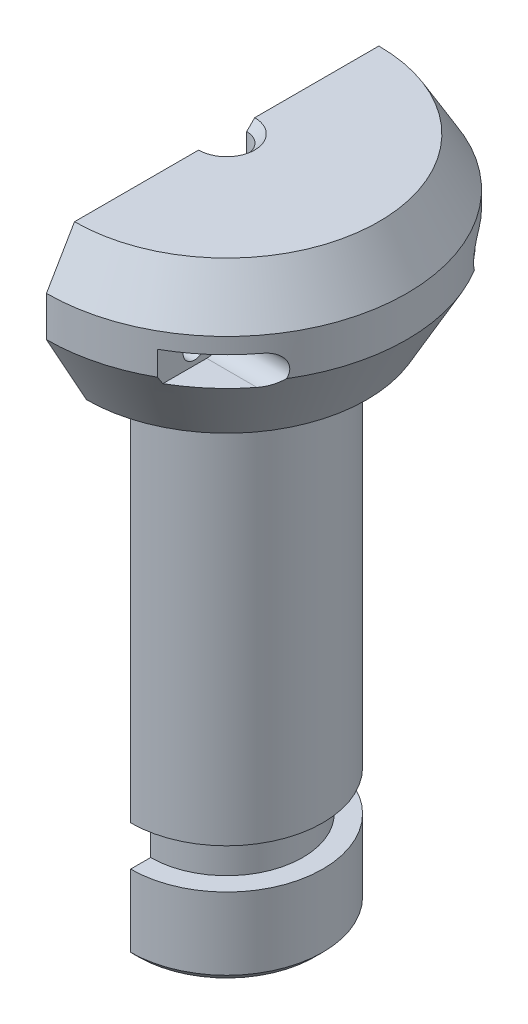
ISO-10303-21;
HEADER;
FILE_DESCRIPTION(('STEP AP214'),'2;1');
FILE_NAME('part.step','',(''),(''),'','','');
FILE_SCHEMA(('AUTOMOTIVE_DESIGN { 1 0 10303 214 1 1 1 1 }'));
ENDSEC;
DATA;
#1=APPLICATION_CONTEXT('core data for automotive mechanical design processes');
#2=APPLICATION_PROTOCOL_DEFINITION('international standard','automotive_design',2000,#1);
#3=PRODUCT_CONTEXT('',#1,'mechanical');
#4=PRODUCT('Part','Part','',(#3));
#5=PRODUCT_RELATED_PRODUCT_CATEGORY('part','',(#4));
#6=PRODUCT_DEFINITION_FORMATION('','',#4);
#7=PRODUCT_DEFINITION_CONTEXT('part definition',#1,'design');
#8=PRODUCT_DEFINITION('design','',#6,#7);
#9=PRODUCT_DEFINITION_SHAPE('','',#8);
#10=(LENGTH_UNIT() NAMED_UNIT(*) SI_UNIT(.MILLI.,.METRE.));
#11=(NAMED_UNIT(*) PLANE_ANGLE_UNIT() SI_UNIT($,.RADIAN.));
#12=(NAMED_UNIT(*) SI_UNIT($,.STERADIAN.) SOLID_ANGLE_UNIT());
#13=UNCERTAINTY_MEASURE_WITH_UNIT(LENGTH_MEASURE(1.E-05),#10,'distance_accuracy_value','');
#14=(GEOMETRIC_REPRESENTATION_CONTEXT(3) GLOBAL_UNCERTAINTY_ASSIGNED_CONTEXT((#13)) GLOBAL_UNIT_ASSIGNED_CONTEXT((#10,
#11,#12)) REPRESENTATION_CONTEXT('',''));
#15=CARTESIAN_POINT('',(0.,0.,0.));
#16=DIRECTION('',(0.,0.,1.));
#17=DIRECTION('',(1.,0.,0.));
#18=AXIS2_PLACEMENT_3D('',#15,#16,#17);
#19=CARTESIAN_POINT('',(0.,-127.,0.));
#20=DIRECTION('',(0.,1.,0.));
#21=DIRECTION('',(0.,0.,1.));
#22=AXIS2_PLACEMENT_3D('',#19,#20,#21);
#23=CYLINDRICAL_SURFACE('',#22,24.);
#24=DIRECTION('',(0.,1.,0.));
#25=VECTOR('',#24,1.);
#26=CARTESIAN_POINT('',(0.,-127.,24.));
#27=LINE('',#26,#25);
#28=CARTESIAN_POINT('',(0.,-125.,24.));
#29=VERTEX_POINT('',#28);
#30=CARTESIAN_POINT('',(0.,-107.,24.));
#31=VERTEX_POINT('',#30);
#32=EDGE_CURVE('E210',#29,#31,#27,.T.);
#33=ORIENTED_EDGE('',*,*,#32,.F.);
#34=CARTESIAN_POINT('',(0.,-125.,0.));
#35=DIRECTION('',(0.,-1.,0.));
#36=DIRECTION('',(0.,0.,-1.));
#37=AXIS2_PLACEMENT_3D('',#34,#35,#36);
#38=CIRCLE('',#37,24.);
#39=CARTESIAN_POINT('',(0.,-125.,-24.));
#40=VERTEX_POINT('',#39);
#41=EDGE_CURVE('E42',#29,#40,#38,.F.);
#42=ORIENTED_EDGE('',*,*,#41,.T.);
#43=DIRECTION('',(0.,1.,0.));
#44=VECTOR('',#43,1.);
#45=CARTESIAN_POINT('',(0.,-127.,-24.));
#46=LINE('',#45,#44);
#47=CARTESIAN_POINT('',(-1.6759110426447E-13,-107.,-24.));
#48=VERTEX_POINT('',#47);
#49=EDGE_CURVE('E385',#40,#48,#46,.T.);
#50=ORIENTED_EDGE('',*,*,#49,.T.);
#51=CARTESIAN_POINT('',(0.,-107.,0.));
#52=DIRECTION('',(0.,-1.,0.));
#53=DIRECTION('',(0.,0.,-1.));
#54=AXIS2_PLACEMENT_3D('',#51,#52,#53);
#55=CIRCLE('',#54,24.);
#56=EDGE_CURVE('E200',#48,#31,#55,.T.);
#57=ORIENTED_EDGE('',*,*,#56,.T.);
#58=EDGE_LOOP('',(#33,#42,#50,#57));
#59=FACE_BOUND('',#58,.T.);
#60=ADVANCED_FACE('F34',(#59),#23,.T.);
#61=CARTESIAN_POINT('',(0.,0.,0.));
#62=DIRECTION('',(0.,1.,0.));
#63=DIRECTION('',(0.,0.,1.));
#64=AXIS2_PLACEMENT_3D('',#61,#62,#63);
#65=PLANE('',#64);
#66=CARTESIAN_POINT('',(0.,0.,0.));
#67=DIRECTION('',(0.,-1.,0.));
#68=DIRECTION('',(0.,0.,-1.));
#69=AXIS2_PLACEMENT_3D('',#66,#67,#68);
#70=CIRCLE('',#69,24.);
#71=CARTESIAN_POINT('',(0.,0.,-24.));
#72=VERTEX_POINT('',#71);
#73=CARTESIAN_POINT('',(0.,0.,24.));
#74=VERTEX_POINT('',#73);
#75=EDGE_CURVE('E361',#72,#74,#70,.T.);
#76=ORIENTED_EDGE('',*,*,#75,.F.);
#77=DIRECTION('',(0.,0.,-1.));
#78=VECTOR('',#77,1.);
#79=CARTESIAN_POINT('',(0.,0.,-45.));
#80=LINE('',#79,#78);
#81=CARTESIAN_POINT('',(0.,0.,-35.));
#82=VERTEX_POINT('',#81);
#83=EDGE_CURVE('E391',#72,#82,#80,.T.);
#84=ORIENTED_EDGE('',*,*,#83,.T.);
#85=CARTESIAN_POINT('',(0.,0.,0.));
#86=DIRECTION('',(0.,1.,0.));
#87=DIRECTION('',(0.,0.,1.));
#88=AXIS2_PLACEMENT_3D('',#85,#86,#87);
#89=CIRCLE('',#88,35.);
#90=CARTESIAN_POINT('',(0.,0.,35.));
#91=VERTEX_POINT('',#90);
#92=EDGE_CURVE('E436',#82,#91,#89,.F.);
#93=ORIENTED_EDGE('',*,*,#92,.T.);
#94=EDGE_CURVE('E393',#91,#74,#80,.T.);
#95=ORIENTED_EDGE('',*,*,#94,.T.);
#96=EDGE_LOOP('',(#76,#84,#93,#95));
#97=FACE_BOUND('',#96,.T.);
#98=ADVANCED_FACE('F338',(#97),#65,.F.);
#99=CARTESIAN_POINT('',(0.,40.,0.));
#100=DIRECTION('',(0.,1.,0.));
#101=DIRECTION('',(0.,0.,1.));
#102=AXIS2_PLACEMENT_3D('',#99,#100,#101);
#103=PLANE('',#102);
#104=DIRECTION('',(0.,0.,-1.));
#105=VECTOR('',#104,1.);
#106=CARTESIAN_POINT('',(0.,40.,-45.));
#107=LINE('',#106,#105);
#108=CARTESIAN_POINT('',(0.,40.,-7.00000000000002));
#109=VERTEX_POINT('',#108);
#110=CARTESIAN_POINT('',(0.,40.,-38.));
#111=VERTEX_POINT('',#110);
#112=EDGE_CURVE('E386',#109,#111,#107,.T.);
#113=ORIENTED_EDGE('',*,*,#112,.F.);
#114=CARTESIAN_POINT('',(0.,40.,0.));
#115=DIRECTION('',(0.,1.,0.));
#116=DIRECTION('',(0.,0.,1.));
#117=AXIS2_PLACEMENT_3D('',#114,#115,#116);
#118=CIRCLE('',#117,7.00000000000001);
#119=CARTESIAN_POINT('',(0.,40.,7.));
#120=VERTEX_POINT('',#119);
#121=EDGE_CURVE('E373',#109,#120,#118,.F.);
#122=ORIENTED_EDGE('',*,*,#121,.T.);
#123=CARTESIAN_POINT('',(0.,40.,38.));
#124=VERTEX_POINT('',#123);
#125=EDGE_CURVE('E387',#124,#120,#107,.T.);
#126=ORIENTED_EDGE('',*,*,#125,.F.);
#127=CARTESIAN_POINT('',(0.,40.,0.));
#128=DIRECTION('',(0.,1.,0.));
#129=DIRECTION('',(0.,0.,1.));
#130=AXIS2_PLACEMENT_3D('',#127,#128,#129);
#131=CIRCLE('',#130,38.);
#132=EDGE_CURVE('E420',#124,#111,#131,.T.);
#133=ORIENTED_EDGE('',*,*,#132,.T.);
#134=EDGE_LOOP('',(#113,#122,#126,#133));
#135=FACE_BOUND('',#134,.T.);
#136=ADVANCED_FACE('F343',(#135),#103,.T.);
#137=CARTESIAN_POINT('',(0.,40.,0.));
#138=DIRECTION('',(0.,-1.,0.));
#139=DIRECTION('',(0.,0.,-1.));
#140=AXIS2_PLACEMENT_3D('',#137,#138,#139);
#141=CYLINDRICAL_SURFACE('',#140,45.);
#142=CARTESIAN_POINT('',(0.,24.05,0.));
#143=DIRECTION('',(0.,1.,0.));
#144=DIRECTION('',(0.,0.,1.));
#145=AXIS2_PLACEMENT_3D('',#142,#143,#144);
#146=CIRCLE('',#145,45.);
#147=CARTESIAN_POINT('',(22.,24.05,39.2555728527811));
#148=VERTEX_POINT('',#147);
#149=CARTESIAN_POINT('',(36.,24.05,27.));
#150=VERTEX_POINT('',#149);
#151=EDGE_CURVE('E287',#148,#150,#146,.T.);
#152=ORIENTED_EDGE('',*,*,#151,.T.);
#153=CARTESIAN_POINT('',(36.,24.05,27.));
#154=CARTESIAN_POINT('',(36.1029639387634,24.0499927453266,26.862731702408));
#155=CARTESIAN_POINT('',(36.2051510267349,24.043019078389,26.7248298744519));
#156=CARTESIAN_POINT('',(36.4073746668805,24.0147038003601,26.4486702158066));
#157=CARTESIAN_POINT('',(36.5074084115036,23.9933444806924,26.3104121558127));
#158=CARTESIAN_POINT('',(36.7049771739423,23.9356729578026,26.0340870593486));
#159=CARTESIAN_POINT('',(36.8024967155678,23.8992845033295,25.8960246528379));
#160=CARTESIAN_POINT('',(36.9936245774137,23.8111650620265,25.6222486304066));
#161=CARTESIAN_POINT('',(37.0872351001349,23.75944285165,25.4865337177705));
#162=CARTESIAN_POINT('',(37.3196823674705,23.6076613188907,25.1456527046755));
#163=CARTESIAN_POINT('',(37.4553017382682,23.4966297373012,24.9430307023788));
#164=CARTESIAN_POINT('',(37.7115838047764,23.2362556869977,24.553830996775));
#165=CARTESIAN_POINT('',(37.8322751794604,23.0869884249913,24.3672227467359));
#166=CARTESIAN_POINT('',(37.9997372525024,22.8344433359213,24.1045849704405));
#167=CARTESIAN_POINT('',(38.0535304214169,22.7449657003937,24.019535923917));
#168=CARTESIAN_POINT('',(38.1558261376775,22.5568749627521,23.8567000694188));
#169=CARTESIAN_POINT('',(38.2043314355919,22.4582666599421,23.778909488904));
#170=CARTESIAN_POINT('',(38.2955260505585,22.2524397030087,23.6317623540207));
#171=CARTESIAN_POINT('',(38.3382155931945,22.1452213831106,23.5624054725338));
#172=CARTESIAN_POINT('',(38.4172589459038,21.9229448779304,23.4333084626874));
#173=CARTESIAN_POINT('',(38.4536140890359,21.8078883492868,23.373566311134));
#174=CARTESIAN_POINT('',(38.5147386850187,21.5880993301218,23.2726849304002));
#175=CARTESIAN_POINT('',(38.5404232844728,21.4842799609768,23.2301048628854));
#176=CARTESIAN_POINT('',(38.5865351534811,21.2724309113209,23.1534297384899));
#177=CARTESIAN_POINT('',(38.606963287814,21.1644019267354,23.1193332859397));
#178=CARTESIAN_POINT('',(38.6423237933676,20.9451053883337,23.0601821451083));
#179=CARTESIAN_POINT('',(38.657260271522,20.8338403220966,23.035120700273));
#180=CARTESIAN_POINT('',(38.6814841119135,20.6089966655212,22.9944200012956));
#181=CARTESIAN_POINT('',(38.6907720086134,20.4954182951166,22.9787798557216));
#182=CARTESIAN_POINT('',(38.7028375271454,20.2804284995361,22.9584513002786));
#183=CARTESIAN_POINT('',(38.7062508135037,20.1791519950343,22.9526937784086));
#184=CARTESIAN_POINT('',(38.7085599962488,19.9763656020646,22.9487993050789));
#185=CARTESIAN_POINT('',(38.7074544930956,19.8748556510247,22.9506647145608));
#186=CARTESIAN_POINT('',(38.7007348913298,19.6724761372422,22.9619938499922));
#187=CARTESIAN_POINT('',(38.6951236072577,19.5716062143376,22.9714528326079));
#188=CARTESIAN_POINT('',(38.6794467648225,19.3711623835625,22.9978397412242));
#189=CARTESIAN_POINT('',(38.6693795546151,19.2715889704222,23.0147704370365));
#190=CARTESIAN_POINT('',(38.6452673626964,19.0775955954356,23.0552346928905));
#191=CARTESIAN_POINT('',(38.6313573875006,18.9831120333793,23.078543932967));
#192=CARTESIAN_POINT('',(38.5995644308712,18.7966683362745,23.1316791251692));
#193=CARTESIAN_POINT('',(38.581680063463,18.7047090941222,23.1615073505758));
#194=CARTESIAN_POINT('',(38.5222784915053,18.4335358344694,23.2602664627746));
#195=CARTESIAN_POINT('',(38.4749913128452,18.2588548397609,23.3385082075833));
#196=CARTESIAN_POINT('',(38.3639043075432,17.9176665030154,23.5206866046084));
#197=CARTESIAN_POINT('',(38.2994222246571,17.7519510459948,23.6256742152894));
#198=CARTESIAN_POINT('',(38.1570222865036,17.4409634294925,23.8549754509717));
#199=CARTESIAN_POINT('',(38.0790998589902,17.2956982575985,23.9792956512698));
#200=CARTESIAN_POINT('',(37.9024863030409,17.0124523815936,24.257607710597));
#201=CARTESIAN_POINT('',(37.8024519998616,16.8770468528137,24.41336011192));
#202=CARTESIAN_POINT('',(37.590692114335,16.6343146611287,24.7381792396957));
#203=CARTESIAN_POINT('',(37.4789597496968,16.527004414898,24.9072536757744));
#204=CARTESIAN_POINT('',(37.2280977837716,16.3258843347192,25.2809578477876));
#205=CARTESIAN_POINT('',(37.0874048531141,16.23673789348,25.4870392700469));
#206=CARTESIAN_POINT('',(36.7967042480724,16.0946002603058,25.9049681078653));
#207=CARTESIAN_POINT('',(36.6466944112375,16.0416174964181,26.1168168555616));
#208=CARTESIAN_POINT('',(36.4127033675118,15.9871322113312,26.4411463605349));
#209=CARTESIAN_POINT('',(36.3309820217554,15.9731346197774,26.5533248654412));
#210=CARTESIAN_POINT('',(36.166350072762,15.9545855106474,26.7771245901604));
#211=CARTESIAN_POINT('',(36.0834432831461,15.9500085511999,26.8887464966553));
#212=CARTESIAN_POINT('',(36.,15.95,27.));
#213=B_SPLINE_CURVE_WITH_KNOTS('',3,(#153,#154,#155,#156,#157,#158,#159,#160,#161,#162,#163,
#164,#165,#166,#167,#168,#169,#170,#171,#172,#173,#174,#175,#176,#177,#178,#179,#180,#181,#182,
#183,#184,#185,#186,#187,#188,#189,#190,#191,#192,#193,#194,#195,#196,#197,#198,#199,#200,#201,
#202,#203,#204,#205,#206,#207,#208,#209,#210,#211,#212),.UNSPECIFIED.,.F.,.F.,(4,2,2,2,2,2,2,2,
2,2,2,2,2,2,2,2,2,2,2,2,2,2,2,2,2,2,2,2,2,4),(0.,0.514694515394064,1.03002377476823,
1.54800034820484,2.06568102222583,2.86605254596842,3.66486172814,4.06833296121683,
4.47159331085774,4.8748380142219,5.27799775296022,5.62285634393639,5.96765816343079,
6.3122015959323,6.65671242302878,6.96082770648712,7.26503718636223,7.5690567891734,
7.87318918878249,8.16776004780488,8.4624337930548,9.05125776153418,9.66827640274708,
10.2855053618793,10.9708835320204,11.6566612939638,12.4486275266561,13.2407782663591,
13.658975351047,14.076041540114),.UNSPECIFIED.);
#214=CARTESIAN_POINT('',(38.3897159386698,18.0000000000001,23.4782816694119));
#215=VERTEX_POINT('',#214);
#216=EDGE_CURVE('E252',#150,#215,#213,.T.);
#217=ORIENTED_EDGE('',*,*,#216,.T.);
#218=CARTESIAN_POINT('',(0.,18.0000000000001,0.));
#219=DIRECTION('',(0.,1.,0.));
#220=DIRECTION('',(0.,0.,1.));
#221=AXIS2_PLACEMENT_3D('',#218,#219,#220);
#222=CIRCLE('',#221,45.);
#223=CARTESIAN_POINT('',(38.3897159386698,18.0000000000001,-23.4782816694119));
#224=VERTEX_POINT('',#223);
#225=EDGE_CURVE('E435',#215,#224,#222,.T.);
#226=ORIENTED_EDGE('',*,*,#225,.T.);
#227=CARTESIAN_POINT('',(32.5714215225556,20.,-31.05));
#228=CARTESIAN_POINT('',(32.5714213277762,19.9074968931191,-31.0500002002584));
#229=CARTESIAN_POINT('',(32.5744492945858,19.8149915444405,-31.0468247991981));
#230=CARTESIAN_POINT('',(32.5864836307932,19.6308018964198,-31.0341933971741));
#231=CARTESIAN_POINT('',(32.5954904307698,19.5391176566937,-31.0247369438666));
#232=CARTESIAN_POINT('',(32.6192705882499,19.3573096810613,-30.999733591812));
#233=CARTESIAN_POINT('',(32.6340459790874,19.2671865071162,-30.9841845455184));
#234=CARTESIAN_POINT('',(32.6690225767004,19.0891912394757,-30.9473037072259));
#235=CARTESIAN_POINT('',(32.689226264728,19.0013201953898,-30.9259692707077));
#236=CARTESIAN_POINT('',(32.7570416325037,18.7432474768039,-30.8541819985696));
#237=CARTESIAN_POINT('',(32.8120605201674,18.5771134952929,-30.7957337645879));
#238=CARTESIAN_POINT('',(32.9381486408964,18.2590969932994,-30.6608362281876));
#239=CARTESIAN_POINT('',(33.0092261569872,18.10722188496,-30.5843776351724));
#240=CARTESIAN_POINT('',(33.195549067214,17.7598971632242,-30.3822509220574));
#241=CARTESIAN_POINT('',(33.3169720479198,17.5720149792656,-30.2492434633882));
#242=CARTESIAN_POINT('',(33.5765347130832,17.2275629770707,-29.9608782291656));
#243=CARTESIAN_POINT('',(33.7147094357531,17.0710606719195,-29.8054734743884));
#244=CARTESIAN_POINT('',(34.0434062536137,16.7480264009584,-29.4300017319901));
#245=CARTESIAN_POINT('',(34.2375078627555,16.5916915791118,-29.2042345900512));
#246=CARTESIAN_POINT('',(34.5349828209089,16.3950212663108,-28.8506326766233));
#247=CARTESIAN_POINT('',(34.6352609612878,16.3357440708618,-28.7301918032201));
#248=CARTESIAN_POINT('',(34.8371739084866,16.2297152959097,-28.4850228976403));
#249=CARTESIAN_POINT('',(34.9388086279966,16.1829629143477,-28.3602951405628));
#250=CARTESIAN_POINT('',(35.2468831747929,16.0606800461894,-27.9779303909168));
#251=CARTESIAN_POINT('',(35.4544054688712,16.0044877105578,-27.714585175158));
#252=CARTESIAN_POINT('',(35.7630353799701,15.9599175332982,-27.3136246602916));
#253=CARTESIAN_POINT('',(35.8655286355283,15.9516873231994,-27.1789005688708));
#254=CARTESIAN_POINT('',(36.0691111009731,15.9487803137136,-26.9081367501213));
#255=CARTESIAN_POINT('',(36.1702000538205,15.9541059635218,-26.7720967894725));
#256=CARTESIAN_POINT('',(36.3763169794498,15.9794405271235,-26.4914270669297));
#257=CARTESIAN_POINT('',(36.4812115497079,16.0003211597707,-26.3467771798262));
#258=CARTESIAN_POINT('',(36.6877522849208,16.0582341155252,-26.0584012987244));
#259=CARTESIAN_POINT('',(36.7893988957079,16.0952642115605,-25.9146751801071));
#260=CARTESIAN_POINT('',(36.9884367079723,16.1859078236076,-25.629781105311));
#261=CARTESIAN_POINT('',(37.0858335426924,16.239498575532,-25.4886099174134));
#262=CARTESIAN_POINT('',(37.2754784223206,16.3636214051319,-25.2104559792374));
#263=CARTESIAN_POINT('',(37.3677287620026,16.4341458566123,-25.0734713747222));
#264=CARTESIAN_POINT('',(37.5823986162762,16.6247259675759,-24.7510458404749));
#265=CARTESIAN_POINT('',(37.7018798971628,16.7532696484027,-24.5684846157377));
#266=CARTESIAN_POINT('',(37.8694603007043,16.9713956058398,-24.3087378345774));
#267=CARTESIAN_POINT('',(37.9233956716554,17.0483515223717,-24.2244798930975));
#268=CARTESIAN_POINT('',(38.0269960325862,17.2105485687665,-24.0615222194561));
#269=CARTESIAN_POINT('',(38.0766631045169,17.2957856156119,-23.982819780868));
#270=CARTESIAN_POINT('',(38.1716821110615,17.4749829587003,-23.831297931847));
#271=CARTESIAN_POINT('',(38.2169956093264,17.569008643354,-23.7585316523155));
#272=CARTESIAN_POINT('',(38.3023784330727,17.7646693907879,-23.620634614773));
#273=CARTESIAN_POINT('',(38.3424503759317,17.8663006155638,-23.5555000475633));
#274=CARTESIAN_POINT('',(38.4169254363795,18.0765243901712,-23.4338415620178));
#275=CARTESIAN_POINT('',(38.4513302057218,18.1851148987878,-23.3773151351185));
#276=CARTESIAN_POINT('',(38.514070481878,18.4084238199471,-23.2738059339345));
#277=CARTESIAN_POINT('',(38.5424070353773,18.5231411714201,-23.2268215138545));
#278=CARTESIAN_POINT('',(38.5893557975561,18.7422737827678,-23.1487238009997));
#279=CARTESIAN_POINT('',(38.608755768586,18.8460686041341,-23.1163374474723));
#280=CARTESIAN_POINT('',(38.6425033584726,19.05669260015,-23.0598789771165));
#281=CARTESIAN_POINT('',(38.6568516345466,19.163521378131,-23.0358057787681));
#282=CARTESIAN_POINT('',(38.6803369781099,19.3792759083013,-22.996348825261));
#283=CARTESIAN_POINT('',(38.6894768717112,19.4882004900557,-22.9809603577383));
#284=CARTESIAN_POINT('',(38.702456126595,19.7072524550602,-22.959095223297));
#285=CARTESIAN_POINT('',(38.7062958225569,19.817379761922,-22.9526179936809));
#286=CARTESIAN_POINT('',(38.7085217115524,20.0273404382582,-22.9488637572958));
#287=CARTESIAN_POINT('',(38.7073924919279,20.1271552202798,-22.9507692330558));
#288=CARTESIAN_POINT('',(38.7007720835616,20.3262596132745,-22.9619311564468));
#289=CARTESIAN_POINT('',(38.6952795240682,20.4255490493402,-22.9711899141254));
#290=CARTESIAN_POINT('',(38.6799826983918,20.6227986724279,-22.9969381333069));
#291=CARTESIAN_POINT('',(38.6701807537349,20.7207595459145,-23.0134237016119));
#292=CARTESIAN_POINT('',(38.6463577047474,20.9147291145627,-23.0534068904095));
#293=CARTESIAN_POINT('',(38.632335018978,21.0107370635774,-23.0769071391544));
#294=CARTESIAN_POINT('',(38.5844334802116,21.2928599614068,-23.1569728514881));
#295=CARTESIAN_POINT('',(38.5445463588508,21.4752876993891,-23.2234008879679));
#296=CARTESIAN_POINT('',(38.4499614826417,21.8255254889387,-23.3796651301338));
#297=CARTESIAN_POINT('',(38.3952608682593,21.9933327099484,-23.4695058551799));
#298=CARTESIAN_POINT('',(38.268609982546,22.3216539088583,-23.6754934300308));
#299=CARTESIAN_POINT('',(38.1957715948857,22.4809905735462,-23.7929677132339));
#300=CARTESIAN_POINT('',(38.0370848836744,22.7773094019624,-24.045840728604));
#301=CARTESIAN_POINT('',(37.9512314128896,22.9142826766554,-24.1812465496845));
#302=CARTESIAN_POINT('',(37.7572556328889,23.1801481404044,-24.4831696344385));
#303=CARTESIAN_POINT('',(37.6476928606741,23.3059639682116,-24.6514645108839));
#304=CARTESIAN_POINT('',(37.4173739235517,23.5275871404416,-24.9996759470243));
#305=CARTESIAN_POINT('',(37.2966116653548,23.623378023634,-25.1795988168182));
#306=CARTESIAN_POINT('',(37.0260274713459,23.7986107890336,-25.5761551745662));
#307=CARTESIAN_POINT('',(36.8746664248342,23.8728936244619,-25.7940154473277));
#308=CARTESIAN_POINT('',(36.5634824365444,23.9832117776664,-26.233268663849));
#309=CARTESIAN_POINT('',(36.4036552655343,24.0192277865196,-26.4546633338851));
#310=CARTESIAN_POINT('',(36.051259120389,24.0577111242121,-26.9334201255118));
#311=CARTESIAN_POINT('',(35.857695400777,24.0535368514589,-27.1905854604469));
#312=CARTESIAN_POINT('',(35.4674255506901,23.9976057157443,-27.6977295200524));
#313=CARTESIAN_POINT('',(35.2707159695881,23.945792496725,-27.9476993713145));
#314=CARTESIAN_POINT('',(34.9659560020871,23.8291028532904,-28.3268844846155));
#315=CARTESIAN_POINT('',(34.8571876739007,23.7801500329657,-28.4605917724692));
#316=CARTESIAN_POINT('',(34.6411688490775,23.66792979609,-28.7231335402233));
#317=CARTESIAN_POINT('',(34.533918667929,23.6046594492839,-28.8519670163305));
#318=CARTESIAN_POINT('',(34.2161641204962,23.3933851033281,-29.2294602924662));
#319=CARTESIAN_POINT('',(34.0091846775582,23.2237411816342,-29.4696967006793));
#320=CARTESIAN_POINT('',(33.6762752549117,22.8862161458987,-29.8488180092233));
#321=CARTESIAN_POINT('',(33.5447866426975,22.7333684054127,-29.9963597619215));
#322=CARTESIAN_POINT('',(33.297684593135,22.3986433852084,-30.2704141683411));
#323=CARTESIAN_POINT('',(33.1820450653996,22.2168149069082,-30.3969614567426));
#324=CARTESIAN_POINT('',(32.9963538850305,21.8671596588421,-30.5982886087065));
#325=CARTESIAN_POINT('',(32.9218482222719,21.7047573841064,-30.6783475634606));
#326=CARTESIAN_POINT('',(32.7914284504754,21.3642978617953,-30.8177114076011));
#327=CARTESIAN_POINT('',(32.7354930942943,21.1862588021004,-30.8770400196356));
#328=CARTESIAN_POINT('',(32.652205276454,20.8414501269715,-30.9650892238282));
#329=CARTESIAN_POINT('',(32.6221307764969,20.676107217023,-30.9967338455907));
#330=CARTESIAN_POINT('',(32.5918228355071,20.4244690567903,-31.0285878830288));
#331=CARTESIAN_POINT('',(32.5841874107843,20.3399550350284,-31.0366038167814));
#332=CARTESIAN_POINT('',(32.5739876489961,20.1702945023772,-31.0473089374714));
#333=CARTESIAN_POINT('',(32.5714217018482,20.0851482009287,-31.0499998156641));
#334=CARTESIAN_POINT('',(32.5714215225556,20.,-31.05));
#335=B_SPLINE_CURVE_WITH_KNOTS('',3,(#227,#228,#229,#230,#231,#232,#233,#234,#235,#236,#237,
#238,#239,#240,#241,#242,#243,#244,#245,#246,#247,#248,#249,#250,#251,#252,#253,#254,#255,#256,
#257,#258,#259,#260,#261,#262,#263,#264,#265,#266,#267,#268,#269,#270,#271,#272,#273,#274,#275,
#276,#277,#278,#279,#280,#281,#282,#283,#284,#285,#286,#287,#288,#289,#290,#291,#292,#293,#294,
#295,#296,#297,#298,#299,#300,#301,#302,#303,#304,#305,#306,#307,#308,#309,#310,#311,#312,#313,
#314,#315,#316,#317,#318,#319,#320,#321,#322,#323,#324,#325,#326,#327,#328,#329,#330,#331,#332,
#333,#334),.UNSPECIFIED.,.T.,.F.,(4,2,2,2,2,2,2,2,2,2,2,2,2,2,2,2,2,2,2,2,2,2,2,2,2,2,2,2,2,2,2,
2,2,2,2,2,2,2,2,2,2,2,2,2,2,2,2,2,2,2,2,2,2,4),(0.,0.277409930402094,0.554839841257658,
0.832367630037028,1.11002249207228,1.66088780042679,2.21203789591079,2.988496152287,
3.7666074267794,4.76982961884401,5.27208262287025,5.7743034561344,6.78917122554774,
7.29719676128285,7.80531409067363,8.34427656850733,8.88316474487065,9.42131544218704,
9.95922423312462,10.7152922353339,11.0935699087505,11.4716620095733,11.8528332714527,
12.2338134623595,12.6146824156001,12.9954856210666,13.3263776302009,13.6572265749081,
13.9878958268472,14.3185441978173,14.6176999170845,14.9169496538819,15.2160383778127,
15.515239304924,16.1070029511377,16.6988809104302,17.3291142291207,17.9595974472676,
18.6677826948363,19.3763555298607,20.1996659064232,21.0233915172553,21.9853028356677,
22.9483535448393,23.4852905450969,24.0223375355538,25.0941480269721,25.841277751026,
26.5871624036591,27.1723355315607,27.7568368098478,28.267342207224,28.5227764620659,
28.778129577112),.UNSPECIFIED.);
#336=CARTESIAN_POINT('',(36.,24.05,-27.));
#337=VERTEX_POINT('',#336);
#338=EDGE_CURVE('E394',#224,#337,#335,.T.);
#339=ORIENTED_EDGE('',*,*,#338,.T.);
#340=CARTESIAN_POINT('',(0.,24.05,0.));
#341=DIRECTION('',(0.,1.,0.));
#342=DIRECTION('',(0.,0.,1.));
#343=AXIS2_PLACEMENT_3D('',#340,#341,#342);
#344=CIRCLE('',#343,45.);
#345=CARTESIAN_POINT('',(22.,24.05,-39.2555728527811));
#346=VERTEX_POINT('',#345);
#347=EDGE_CURVE('E322',#337,#346,#344,.T.);
#348=ORIENTED_EDGE('',*,*,#347,.T.);
#349=DIRECTION('',(0.,-1.,0.));
#350=VECTOR('',#349,1.);
#351=CARTESIAN_POINT('',(22.,40.,-39.2555728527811));
#352=LINE('',#351,#350);
#353=CARTESIAN_POINT('',(22.,18.0000000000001,-39.2555728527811));
#354=VERTEX_POINT('',#353);
#355=EDGE_CURVE('E455',#354,#346,#352,.F.);
#356=ORIENTED_EDGE('',*,*,#355,.F.);
#357=CARTESIAN_POINT('',(0.,18.0000000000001,-45.));
#358=VERTEX_POINT('',#357);
#359=EDGE_CURVE('E431',#354,#358,#222,.T.);
#360=ORIENTED_EDGE('',*,*,#359,.T.);
#361=DIRECTION('',(0.,1.,0.));
#362=VECTOR('',#361,1.);
#363=CARTESIAN_POINT('',(0.,0.,-45.));
#364=LINE('',#363,#362);
#365=CARTESIAN_POINT('',(0.,27.9999999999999,-45.));
#366=VERTEX_POINT('',#365);
#367=EDGE_CURVE('E411',#358,#366,#364,.T.);
#368=ORIENTED_EDGE('',*,*,#367,.T.);
#369=CARTESIAN_POINT('',(0.,27.9999999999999,0.));
#370=DIRECTION('',(0.,1.,0.));
#371=DIRECTION('',(0.,0.,1.));
#372=AXIS2_PLACEMENT_3D('',#369,#370,#371);
#373=CIRCLE('',#372,45.);
#374=CARTESIAN_POINT('',(0.,27.9999999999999,45.));
#375=VERTEX_POINT('',#374);
#376=EDGE_CURVE('E426',#366,#375,#373,.F.);
#377=ORIENTED_EDGE('',*,*,#376,.T.);
#378=DIRECTION('',(0.,1.,0.));
#379=VECTOR('',#378,1.);
#380=CARTESIAN_POINT('',(0.,0.,45.));
#381=LINE('',#380,#379);
#382=CARTESIAN_POINT('',(0.,18.0000000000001,45.));
#383=VERTEX_POINT('',#382);
#384=EDGE_CURVE('E401',#383,#375,#381,.T.);
#385=ORIENTED_EDGE('',*,*,#384,.F.);
#386=CARTESIAN_POINT('',(22.,18.0000000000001,39.2555728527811));
#387=VERTEX_POINT('',#386);
#388=EDGE_CURVE('E432',#383,#387,#222,.T.);
#389=ORIENTED_EDGE('',*,*,#388,.T.);
#390=DIRECTION('',(0.,-1.,0.));
#391=VECTOR('',#390,1.);
#392=CARTESIAN_POINT('',(22.,40.,39.2555728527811));
#393=LINE('',#392,#391);
#394=EDGE_CURVE('E248',#148,#387,#393,.T.);
#395=ORIENTED_EDGE('',*,*,#394,.F.);
#396=EDGE_LOOP('',(#152,#217,#226,#339,#348,#356,#360,#368,#377,#385,#389,#395));
#397=FACE_BOUND('',#396,.T.);
#398=ADVANCED_FACE('F262',(#397),#141,.T.);
#399=CARTESIAN_POINT('',(0.,40.,0.));
#400=DIRECTION('',(0.,-1.,0.));
#401=DIRECTION('',(0.,0.,-1.));
#402=AXIS2_PLACEMENT_3D('',#399,#400,#401);
#403=CYLINDRICAL_SURFACE('',#402,5.);
#404=DIRECTION('',(0.,-1.,0.));
#405=VECTOR('',#404,1.);
#406=CARTESIAN_POINT('',(0.,40.,-5.));
#407=LINE('',#406,#405);
#408=CARTESIAN_POINT('',(0.,-125.,-5.));
#409=VERTEX_POINT('',#408);
#410=CARTESIAN_POINT('',(0.,38.,-5.));
#411=VERTEX_POINT('',#410);
#412=EDGE_CURVE('E413',#409,#411,#407,.F.);
#413=ORIENTED_EDGE('',*,*,#412,.F.);
#414=CARTESIAN_POINT('',(0.,-125.,0.));
#415=DIRECTION('',(0.,-1.,0.));
#416=DIRECTION('',(0.,0.,-1.));
#417=AXIS2_PLACEMENT_3D('',#414,#415,#416);
#418=CIRCLE('',#417,5.);
#419=CARTESIAN_POINT('',(0.,-125.,4.99999999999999));
#420=VERTEX_POINT('',#419);
#421=EDGE_CURVE('E625',#409,#420,#418,.T.);
#422=ORIENTED_EDGE('',*,*,#421,.T.);
#423=DIRECTION('',(0.,-1.,0.));
#424=VECTOR('',#423,1.);
#425=CARTESIAN_POINT('',(0.,40.,5.));
#426=LINE('',#425,#424);
#427=CARTESIAN_POINT('',(0.,38.,5.));
#428=VERTEX_POINT('',#427);
#429=EDGE_CURVE('E417',#428,#420,#426,.T.);
#430=ORIENTED_EDGE('',*,*,#429,.F.);
#431=CARTESIAN_POINT('',(0.,38.,0.));
#432=DIRECTION('',(0.,1.,0.));
#433=DIRECTION('',(0.,0.,1.));
#434=AXIS2_PLACEMENT_3D('',#431,#432,#433);
#435=CIRCLE('',#434,5.);
#436=EDGE_CURVE('E622',#428,#411,#435,.T.);
#437=ORIENTED_EDGE('',*,*,#436,.T.);
#438=EDGE_LOOP('',(#413,#422,#430,#437));
#439=FACE_BOUND('',#438,.T.);
#440=ADVANCED_FACE('F582',(#439),#403,.F.);
#441=CARTESIAN_POINT('',(0.,0.,-45.));
#442=DIRECTION('',(1.,0.,0.));
#443=DIRECTION('',(0.,0.,-1.));
#444=AXIS2_PLACEMENT_3D('',#441,#442,#443);
#445=PLANE('',#444);
#446=CARTESIAN_POINT('',(0.,20.,-30.));
#447=DIRECTION('',(1.,0.,0.));
#448=DIRECTION('',(0.,0.,-1.));
#449=AXIS2_PLACEMENT_3D('',#446,#447,#448);
#450=CIRCLE('',#449,2.9);
#451=CARTESIAN_POINT('',(0.,20.,-32.9));
#452=VERTEX_POINT('',#451);
#453=EDGE_CURVE('E227',#452,#452,#450,.T.);
#454=ORIENTED_EDGE('',*,*,#453,.T.);
#455=EDGE_LOOP('',(#454));
#456=FACE_BOUND('',#455,.T.);
#457=ORIENTED_EDGE('',*,*,#49,.F.);
#458=DIRECTION('',(0.,0.707106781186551,-0.707106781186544));
#459=VECTOR('',#458,1.);
#460=CARTESIAN_POINT('',(0.,-149.,0.));
#461=LINE('',#460,#459);
#462=CARTESIAN_POINT('',(0.,-127.,-22.));
#463=VERTEX_POINT('',#462);
#464=EDGE_CURVE('E11',#40,#463,#461,.F.);
#465=ORIENTED_EDGE('',*,*,#464,.T.);
#466=DIRECTION('',(0.,0.,-1.));
#467=VECTOR('',#466,1.);
#468=CARTESIAN_POINT('',(0.,-127.,-5.));
#469=LINE('',#468,#467);
#470=CARTESIAN_POINT('',(0.,-127.,-6.99999999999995));
#471=VERTEX_POINT('',#470);
#472=EDGE_CURVE('E368',#471,#463,#469,.T.);
#473=ORIENTED_EDGE('',*,*,#472,.F.);
#474=DIRECTION('',(0.,0.707106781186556,0.707106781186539));
#475=VECTOR('',#474,1.);
#476=CARTESIAN_POINT('',(0.,-120.,0.));
#477=LINE('',#476,#475);
#478=EDGE_CURVE('E618',#471,#409,#477,.T.);
#479=ORIENTED_EDGE('',*,*,#478,.T.);
#480=ORIENTED_EDGE('',*,*,#412,.T.);
#481=DIRECTION('',(0.,0.707106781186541,-0.707106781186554));
#482=VECTOR('',#481,1.);
#483=CARTESIAN_POINT('',(0.,33.0000000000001,0.));
#484=LINE('',#483,#482);
#485=EDGE_CURVE('E617',#411,#109,#484,.T.);
#486=ORIENTED_EDGE('',*,*,#485,.T.);
#487=ORIENTED_EDGE('',*,*,#112,.T.);
#488=DIRECTION('',(0.,0.863778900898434,0.503871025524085));
#489=VECTOR('',#488,1.);
#490=CARTESIAN_POINT('',(0.,105.142857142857,0.));
#491=LINE('',#490,#489);
#492=EDGE_CURVE('E423',#111,#366,#491,.F.);
#493=ORIENTED_EDGE('',*,*,#492,.T.);
#494=ORIENTED_EDGE('',*,*,#367,.F.);
#495=DIRECTION('',(0.,0.874157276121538,-0.485642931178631));
#496=VECTOR('',#495,1.);
#497=CARTESIAN_POINT('',(0.,-63.0000000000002,0.));
#498=LINE('',#497,#496);
#499=EDGE_CURVE('E398',#358,#82,#498,.F.);
#500=ORIENTED_EDGE('',*,*,#499,.T.);
#501=ORIENTED_EDGE('',*,*,#83,.F.);
#502=CARTESIAN_POINT('',(0.,-97.,-24.));
#503=VERTEX_POINT('',#502);
#504=EDGE_CURVE('E366',#503,#72,#46,.T.);
#505=ORIENTED_EDGE('',*,*,#504,.F.);
#506=DIRECTION('',(0.,0.,1.));
#507=VECTOR('',#506,1.);
#508=CARTESIAN_POINT('',(-1.32676290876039E-13,-97.,-19.));
#509=LINE('',#508,#507);
#510=CARTESIAN_POINT('',(-1.32676290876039E-13,-97.,-19.));
#511=VERTEX_POINT('',#510);
#512=EDGE_CURVE('E218',#503,#511,#509,.T.);
#513=ORIENTED_EDGE('',*,*,#512,.T.);
#514=DIRECTION('',(0.,-1.,0.));
#515=VECTOR('',#514,1.);
#516=CARTESIAN_POINT('',(-1.32676290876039E-13,-97.,-19.));
#517=LINE('',#516,#515);
#518=CARTESIAN_POINT('',(-1.32676290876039E-13,-107.,-19.));
#519=VERTEX_POINT('',#518);
#520=EDGE_CURVE('E213',#511,#519,#517,.T.);
#521=ORIENTED_EDGE('',*,*,#520,.T.);
#522=DIRECTION('',(0.,0.,-1.));
#523=VECTOR('',#522,1.);
#524=CARTESIAN_POINT('',(-1.32676290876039E-13,-107.,-19.));
#525=LINE('',#524,#523);
#526=EDGE_CURVE('E195',#519,#48,#525,.T.);
#527=ORIENTED_EDGE('',*,*,#526,.T.);
#528=EDGE_LOOP('',(#457,#465,#473,#479,#480,#486,#487,#493,#494,#500,#501,#505,#513,#521,#527));
#529=FACE_BOUND('',#528,.T.);
#530=ADVANCED_FACE('F395',(#456,#529),#445,.F.);
#531=CARTESIAN_POINT('',(0.,20.,30.));
#532=DIRECTION('',(1.,0.,0.));
#533=DIRECTION('',(0.,0.,-1.));
#534=AXIS2_PLACEMENT_3D('',#531,#532,#533);
#535=CIRCLE('',#534,2.9);
#536=CARTESIAN_POINT('',(0.,20.,27.1));
#537=VERTEX_POINT('',#536);
#538=EDGE_CURVE('E233',#537,#537,#535,.T.);
#539=ORIENTED_EDGE('',*,*,#538,.T.);
#540=EDGE_LOOP('',(#539));
#541=FACE_BOUND('',#540,.T.);
#542=DIRECTION('',(0.,0.,-1.));
#543=VECTOR('',#542,1.);
#544=CARTESIAN_POINT('',(0.,-127.,5.));
#545=LINE('',#544,#543);
#546=CARTESIAN_POINT('',(0.,-127.,22.));
#547=VERTEX_POINT('',#546);
#548=CARTESIAN_POINT('',(0.,-127.,6.99999999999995));
#549=VERTEX_POINT('',#548);
#550=EDGE_CURVE('E364',#547,#549,#545,.T.);
#551=ORIENTED_EDGE('',*,*,#550,.F.);
#552=DIRECTION('',(0.,-0.707106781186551,-0.707106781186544));
#553=VECTOR('',#552,1.);
#554=CARTESIAN_POINT('',(0.,-149.,0.));
#555=LINE('',#554,#553);
#556=EDGE_CURVE('E56',#547,#29,#555,.F.);
#557=ORIENTED_EDGE('',*,*,#556,.T.);
#558=ORIENTED_EDGE('',*,*,#32,.T.);
#559=DIRECTION('',(0.,0.,1.));
#560=VECTOR('',#559,1.);
#561=CARTESIAN_POINT('',(0.,-107.,19.));
#562=LINE('',#561,#560);
#563=CARTESIAN_POINT('',(0.,-107.,19.));
#564=VERTEX_POINT('',#563);
#565=EDGE_CURVE('E192',#564,#31,#562,.T.);
#566=ORIENTED_EDGE('',*,*,#565,.F.);
#567=DIRECTION('',(0.,-1.,0.));
#568=VECTOR('',#567,1.);
#569=CARTESIAN_POINT('',(0.,-97.,19.));
#570=LINE('',#569,#568);
#571=CARTESIAN_POINT('',(0.,-97.,19.));
#572=VERTEX_POINT('',#571);
#573=EDGE_CURVE('E203',#572,#564,#570,.T.);
#574=ORIENTED_EDGE('',*,*,#573,.F.);
#575=DIRECTION('',(0.,0.,-1.));
#576=VECTOR('',#575,1.);
#577=CARTESIAN_POINT('',(0.,-97.,19.));
#578=LINE('',#577,#576);
#579=CARTESIAN_POINT('',(0.,-97.,24.));
#580=VERTEX_POINT('',#579);
#581=EDGE_CURVE('E211',#580,#572,#578,.T.);
#582=ORIENTED_EDGE('',*,*,#581,.F.);
#583=EDGE_CURVE('E358',#580,#74,#27,.T.);
#584=ORIENTED_EDGE('',*,*,#583,.T.);
#585=ORIENTED_EDGE('',*,*,#94,.F.);
#586=DIRECTION('',(0.,-0.874157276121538,-0.485642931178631));
#587=VECTOR('',#586,1.);
#588=CARTESIAN_POINT('',(0.,-63.0000000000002,0.));
#589=LINE('',#588,#587);
#590=EDGE_CURVE('E405',#91,#383,#589,.F.);
#591=ORIENTED_EDGE('',*,*,#590,.T.);
#592=ORIENTED_EDGE('',*,*,#384,.T.);
#593=DIRECTION('',(0.,-0.863778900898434,0.503871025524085));
#594=VECTOR('',#593,1.);
#595=CARTESIAN_POINT('',(0.,105.142857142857,0.));
#596=LINE('',#595,#594);
#597=EDGE_CURVE('E429',#375,#124,#596,.F.);
#598=ORIENTED_EDGE('',*,*,#597,.T.);
#599=ORIENTED_EDGE('',*,*,#125,.T.);
#600=DIRECTION('',(0.,-0.707106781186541,-0.707106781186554));
#601=VECTOR('',#600,1.);
#602=CARTESIAN_POINT('',(0.,33.0000000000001,0.));
#603=LINE('',#602,#601);
#604=EDGE_CURVE('E627',#120,#428,#603,.T.);
#605=ORIENTED_EDGE('',*,*,#604,.T.);
#606=ORIENTED_EDGE('',*,*,#429,.T.);
#607=DIRECTION('',(0.,-0.707106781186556,0.707106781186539));
#608=VECTOR('',#607,1.);
#609=CARTESIAN_POINT('',(0.,-120.,0.));
#610=LINE('',#609,#608);
#611=EDGE_CURVE('E628',#420,#549,#610,.T.);
#612=ORIENTED_EDGE('',*,*,#611,.T.);
#613=EDGE_LOOP('',(#551,#557,#558,#566,#574,#582,#584,#585,#591,#592,#598,#599,#605,#606,#612));
#614=FACE_BOUND('',#613,.T.);
#615=ADVANCED_FACE('F209',(#541,#614),#445,.F.);
#616=CARTESIAN_POINT('',(0.,40.,0.));
#617=DIRECTION('',(0.,-1.,0.));
#618=DIRECTION('',(0.,0.,-1.));
#619=AXIS2_PLACEMENT_3D('',#616,#617,#618);
#620=CONICAL_SURFACE('',#619,38.,0.528074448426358);
#621=ORIENTED_EDGE('',*,*,#597,.F.);
#622=ORIENTED_EDGE('',*,*,#376,.F.);
#623=ORIENTED_EDGE('',*,*,#492,.F.);
#624=ORIENTED_EDGE('',*,*,#132,.F.);
#625=EDGE_LOOP('',(#621,#622,#623,#624));
#626=FACE_BOUND('',#625,.T.);
#627=ADVANCED_FACE('F296',(#626),#620,.T.);
#628=CARTESIAN_POINT('',(0.,18.0000000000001,0.));
#629=DIRECTION('',(0.,1.,0.));
#630=DIRECTION('',(0.,0.,1.));
#631=AXIS2_PLACEMENT_3D('',#628,#629,#630);
#632=CONICAL_SURFACE('',#631,45.,0.507098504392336);
#633=CARTESIAN_POINT('',(34.2599261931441,15.9703209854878,27.4052000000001));
#634=CARTESIAN_POINT('',(34.3610924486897,15.9563962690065,27.2663625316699));
#635=CARTESIAN_POINT('',(34.4650161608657,15.9497876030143,27.1289385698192));
#636=CARTESIAN_POINT('',(34.6771307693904,15.9502234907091,26.8576604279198));
#637=CARTESIAN_POINT('',(34.7853170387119,15.9572536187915,26.7238026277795));
#638=CARTESIAN_POINT('',(35.0045838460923,15.9839211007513,26.4605164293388));
#639=CARTESIAN_POINT('',(35.115654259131,16.0035189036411,26.3310754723));
#640=CARTESIAN_POINT('',(35.3402070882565,16.0545215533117,26.0766686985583));
#641=CARTESIAN_POINT('',(35.4536902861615,16.0859302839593,25.9517043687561));
#642=CARTESIAN_POINT('',(35.806402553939,16.2000259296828,25.5738657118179));
#643=CARTESIAN_POINT('',(36.0485978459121,16.3013923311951,25.3291689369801));
#644=CARTESIAN_POINT('',(36.5358697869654,16.5481035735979,24.8655332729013));
#645=CARTESIAN_POINT('',(36.7809502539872,16.6935149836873,24.6466340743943));
#646=CARTESIAN_POINT('',(37.1581105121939,16.9489010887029,24.3328660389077));
#647=CARTESIAN_POINT('',(37.2907516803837,17.044793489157,24.2269604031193));
#648=CARTESIAN_POINT('',(37.5550584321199,17.2479293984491,24.0252584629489));
#649=CARTESIAN_POINT('',(37.6867240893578,17.3551720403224,23.9294613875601));
#650=CARTESIAN_POINT('',(37.9482687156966,17.5803034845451,23.7490995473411));
#651=CARTESIAN_POINT('',(38.0781498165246,17.698178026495,23.6645201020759));
#652=CARTESIAN_POINT('',(38.3356622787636,17.9441632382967,23.5075365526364));
#653=CARTESIAN_POINT('',(38.4632927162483,18.0722779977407,23.4351373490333));
#654=CARTESIAN_POINT('',(38.5894251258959,18.2052000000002,23.3694087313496));
#655=B_SPLINE_CURVE_WITH_KNOTS('',3,(#633,#634,#635,#636,#637,#638,#639,#640,#641,#642,#643,
#644,#645,#646,#647,#648,#649,#650,#651,#652,#653,#654),.UNSPECIFIED.,.F.,.F.,(4,2,2,2,2,2,2,2,
2,2,4),(0.,0.516702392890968,1.03285857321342,1.54739830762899,2.06210738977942,
3.13473197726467,4.20898587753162,4.79332285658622,5.37761523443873,5.96113524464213,
6.54488946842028),.UNSPECIFIED.);
#656=CARTESIAN_POINT('',(34.565836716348,15.95,27.));
#657=VERTEX_POINT('',#656);
#658=EDGE_CURVE('E280',#657,#215,#655,.T.);
#659=ORIENTED_EDGE('',*,*,#658,.F.);
#660=CARTESIAN_POINT('',(0.,15.95,0.));
#661=DIRECTION('',(0.,-1.,0.));
#662=DIRECTION('',(0.,0.,-1.));
#663=AXIS2_PLACEMENT_3D('',#660,#661,#662);
#664=CIRCLE('',#663,43.8611111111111);
#665=CARTESIAN_POINT('',(22.,15.95,37.9446579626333));
#666=VERTEX_POINT('',#665);
#667=EDGE_CURVE('E288',#666,#657,#664,.F.);
#668=ORIENTED_EDGE('',*,*,#667,.F.);
#669=CARTESIAN_POINT('',(22.,-16.125454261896,13.9339606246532));
#670=CARTESIAN_POINT('',(22.,-15.8725330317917,14.196541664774));
#671=CARTESIAN_POINT('',(22.,-15.6169982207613,14.4565862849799));
#672=CARTESIAN_POINT('',(22.,-15.1012622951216,14.9719727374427));
#673=CARTESIAN_POINT('',(22.,-14.8410615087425,15.2273148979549));
#674=CARTESIAN_POINT('',(22.,-14.3166060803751,15.7336190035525));
#675=CARTESIAN_POINT('',(22.,-14.052352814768,15.9845823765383));
#676=CARTESIAN_POINT('',(22.,-13.5201445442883,16.4825580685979));
#677=CARTESIAN_POINT('',(22.,-13.252189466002,16.7295703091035));
#678=CARTESIAN_POINT('',(22.,-12.4439841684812,17.4645911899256));
#679=CARTESIAN_POINT('',(22.,-11.8987859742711,17.9471675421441));
#680=CARTESIAN_POINT('',(22.,-10.7976534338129,18.899970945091));
#681=CARTESIAN_POINT('',(22.,-10.2417180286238,19.3701967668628));
#682=CARTESIAN_POINT('',(22.,-9.12230016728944,20.2989309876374));
#683=CARTESIAN_POINT('',(22.,-8.55883784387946,20.7574636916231));
#684=CARTESIAN_POINT('',(22.,-7.42459183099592,21.6653265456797));
#685=CARTESIAN_POINT('',(22.,-6.85380838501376,22.1146570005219));
#686=CARTESIAN_POINT('',(22.,-5.7058455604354,23.0054574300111));
#687=CARTESIAN_POINT('',(22.,-5.12866412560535,23.4469247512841));
#688=CARTESIAN_POINT('',(22.,-3.96899388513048,24.3228341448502));
#689=CARTESIAN_POINT('',(22.,-3.38650503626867,24.7572761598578));
#690=CARTESIAN_POINT('',(22.,-2.21873354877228,25.6186519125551));
#691=CARTESIAN_POINT('',(22.,-1.6334647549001,26.0456044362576));
#692=CARTESIAN_POINT('',(22.,-0.458974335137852,26.8940410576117));
#693=CARTESIAN_POINT('',(22.,0.130247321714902,27.3155251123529));
#694=CARTESIAN_POINT('',(22.,1.90292872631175,28.5725792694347));
#695=CARTESIAN_POINT('',(22.,3.09155824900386,29.400863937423));
#696=CARTESIAN_POINT('',(22.,5.48011853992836,31.0421920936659));
#697=CARTESIAN_POINT('',(22.,6.6800545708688,31.8552278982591));
#698=CARTESIAN_POINT('',(22.,9.08852893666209,33.4684941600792));
#699=CARTESIAN_POINT('',(22.,10.2970674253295,34.2687243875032));
#700=CARTESIAN_POINT('',(22.,11.8919344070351,35.3147192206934));
#701=CARTESIAN_POINT('',(22.,12.275128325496,35.5652780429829));
#702=CARTESIAN_POINT('',(22.,13.0421466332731,36.0653711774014));
#703=CARTESIAN_POINT('',(22.,13.4259709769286,36.3149055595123));
#704=CARTESIAN_POINT('',(22.,14.1943222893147,36.8130781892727));
#705=CARTESIAN_POINT('',(22.,14.5788493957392,37.0617162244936));
#706=CARTESIAN_POINT('',(22.,15.3484940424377,37.5580947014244));
#707=CARTESIAN_POINT('',(22.,15.7336115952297,37.8058351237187));
#708=CARTESIAN_POINT('',(22.,17.5286577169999,38.9577558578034));
#709=CARTESIAN_POINT('',(22.,18.9419759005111,39.8566594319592));
#710=CARTESIAN_POINT('',(22.,21.7745863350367,41.6450108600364));
#711=CARTESIAN_POINT('',(22.,23.1938786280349,42.5344586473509));
#712=CARTESIAN_POINT('',(22.,26.0374505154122,44.305430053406));
#713=CARTESIAN_POINT('',(22.,27.4617302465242,45.186953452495));
#714=CARTESIAN_POINT('',(22.,30.3144416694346,46.9432572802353));
#715=CARTESIAN_POINT('',(22.,31.7428733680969,47.8180376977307));
#716=CARTESIAN_POINT('',(22.,34.6015397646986,49.5607778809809));
#717=CARTESIAN_POINT('',(22.,36.0317702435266,50.4287445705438));
#718=CARTESIAN_POINT('',(22.,38.8952394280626,52.1597044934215));
#719=CARTESIAN_POINT('',(22.,40.328478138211,53.022697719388));
#720=CARTESIAN_POINT('',(22.,43.1974186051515,54.7442854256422));
#721=CARTESIAN_POINT('',(22.,44.6331201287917,55.6028802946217));
#722=CARTESIAN_POINT('',(22.,47.5067828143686,57.316266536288));
#723=CARTESIAN_POINT('',(22.,48.9447439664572,58.1710579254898));
#724=CARTESIAN_POINT('',(22.,50.3836751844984,59.0242098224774));
#725=B_SPLINE_CURVE_WITH_KNOTS('',3,(#669,#670,#671,#672,#673,#674,#675,#676,#677,#678,#679,
#680,#681,#682,#683,#684,#685,#686,#687,#688,#689,#690,#691,#692,#693,#694,#695,#696,#697,#698,
#699,#700,#701,#702,#703,#704,#705,#706,#707,#708,#709,#710,#711,#712,#713,#714,#715,#716,#717,
#718,#719,#720,#721,#722,#723,#724),.UNSPECIFIED.,.F.,.F.,(4,2,2,2,2,2,2,2,2,2,2,2,2,2,2,2,2,2,
2,2,2,2,2,2,2,2,2,4),(0.,1.0936992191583,2.18732180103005,3.28058082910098,4.37386156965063,
6.55789594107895,8.74214682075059,10.9214099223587,13.1006007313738,15.280513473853,
17.4604439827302,19.633758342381,21.8070897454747,26.1531819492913,30.5014082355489,
34.8497124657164,36.2232313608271,37.5966548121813,38.9703847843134,40.3441442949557,
45.368975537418,50.3938421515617,55.4188476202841,60.4438614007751,65.462846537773,
70.4818390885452,75.5003801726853,80.5188994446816),.UNSPECIFIED.);
#726=EDGE_CURVE('E316',#666,#387,#725,.T.);
#727=ORIENTED_EDGE('',*,*,#726,.T.);
#728=ORIENTED_EDGE('',*,*,#388,.F.);
#729=ORIENTED_EDGE('',*,*,#590,.F.);
#730=ORIENTED_EDGE('',*,*,#92,.F.);
#731=ORIENTED_EDGE('',*,*,#499,.F.);
#732=ORIENTED_EDGE('',*,*,#359,.F.);
#733=CARTESIAN_POINT('',(22.,50.3836751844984,-59.0242098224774));
#734=CARTESIAN_POINT('',(22.,48.9419976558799,-58.1694294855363));
#735=CARTESIAN_POINT('',(22.,47.5012938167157,-57.3130035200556));
#736=CARTESIAN_POINT('',(22.,44.6221575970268,-55.5963341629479));
#737=CARTESIAN_POINT('',(22.,43.183725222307,-54.7360907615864));
#738=CARTESIAN_POINT('',(22.,40.3098774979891,-53.0115132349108));
#739=CARTESIAN_POINT('',(22.,38.8744613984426,-52.1471803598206));
#740=CARTESIAN_POINT('',(22.,36.0066464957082,-50.4135205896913));
#741=CARTESIAN_POINT('',(22.,34.5742476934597,-49.5441936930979));
#742=CARTESIAN_POINT('',(22.,31.7161488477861,-47.8016905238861));
#743=CARTESIAN_POINT('',(22.,30.2904409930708,-46.9285270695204));
#744=CARTESIAN_POINT('',(22.,27.4431672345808,-45.1754781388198));
#745=CARTESIAN_POINT('',(22.,26.0216013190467,-44.2955926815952));
#746=CARTESIAN_POINT('',(22.,23.1829535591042,-42.5276207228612));
#747=CARTESIAN_POINT('',(22.,21.765873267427,-41.6395317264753));
#748=CARTESIAN_POINT('',(22.,18.9376490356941,-39.8539057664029));
#749=CARTESIAN_POINT('',(22.,17.5265051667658,-38.9563686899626));
#750=CARTESIAN_POINT('',(22.,14.7066499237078,-37.1468169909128));
#751=CARTESIAN_POINT('',(22.,13.2979636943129,-36.2347631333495));
#752=CARTESIAN_POINT('',(22.,10.4897843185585,-34.3967127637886));
#753=CARTESIAN_POINT('',(22.,9.09029081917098,-33.4707167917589));
#754=CARTESIAN_POINT('',(22.,6.30396237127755,-31.602117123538));
#755=CARTESIAN_POINT('',(22.,4.91711849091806,-30.6595267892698));
#756=CARTESIAN_POINT('',(22.,2.84809735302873,-29.2291471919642));
#757=CARTESIAN_POINT('',(22.,2.16024290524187,-28.7495657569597));
#758=CARTESIAN_POINT('',(22.,0.788921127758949,-27.7841751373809));
#759=CARTESIAN_POINT('',(22.,0.105453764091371,-27.2983660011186));
#760=CARTESIAN_POINT('',(22.,-1.25844989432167,-26.3181690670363));
#761=CARTESIAN_POINT('',(22.,-1.93887072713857,-25.8237597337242));
#762=CARTESIAN_POINT('',(22.,-3.29368128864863,-24.8267508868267));
#763=CARTESIAN_POINT('',(22.,-3.96807108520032,-24.3241514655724));
#764=CARTESIAN_POINT('',(22.,-5.30942443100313,-23.3096854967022));
#765=CARTESIAN_POINT('',(22.,-5.97639088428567,-22.7978227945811));
#766=CARTESIAN_POINT('',(22.,-7.30176327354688,-21.7630473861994));
#767=CARTESIAN_POINT('',(22.,-7.96016881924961,-21.2401341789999));
#768=CARTESIAN_POINT('',(22.,-9.26824628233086,-20.1799423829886));
#769=CARTESIAN_POINT('',(22.,-9.91789018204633,-19.6426291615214));
#770=CARTESIAN_POINT('',(22.,-11.2040669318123,-18.5526289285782));
#771=CARTESIAN_POINT('',(22.,-11.8406015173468,-17.9999439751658));
#772=CARTESIAN_POINT('',(22.,-12.7834492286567,-17.1566757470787));
#773=CARTESIAN_POINT('',(22.,-13.0959556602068,-16.8730077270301));
#774=CARTESIAN_POINT('',(22.,-13.7162579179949,-16.3005769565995));
#775=CARTESIAN_POINT('',(22.,-14.024053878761,-16.0118143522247));
#776=CARTESIAN_POINT('',(22.,-14.6344365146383,-15.4285539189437));
#777=CARTESIAN_POINT('',(22.,-14.9370208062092,-15.1340535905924));
#778=CARTESIAN_POINT('',(22.,-15.5360527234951,-14.5388217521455));
#779=CARTESIAN_POINT('',(22.,-15.8324997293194,-14.2380896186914));
#780=CARTESIAN_POINT('',(22.,-16.125454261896,-13.9339606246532));
#781=B_SPLINE_CURVE_WITH_KNOTS('',3,(#733,#734,#735,#736,#737,#738,#739,#740,#741,#742,#743,
#744,#745,#746,#747,#748,#749,#750,#751,#752,#753,#754,#755,#756,#757,#758,#759,#760,#761,#762,
#763,#764,#765,#766,#767,#768,#769,#770,#771,#772,#773,#774,#775,#776,#777,#778,#779,#780),
.UNSPECIFIED.,.F.,.F.,(4,2,2,2,2,2,2,2,2,2,2,2,2,2,2,2,2,2,2,2,2,2,2,4),(0.,5.02809771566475,
10.0562082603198,15.0828698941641,20.1095330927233,25.1250447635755,30.140542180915,
35.1576187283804,40.1747552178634,45.209182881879,50.2434160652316,55.2737659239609,
57.7893453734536,60.3049053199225,62.8280884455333,65.3512431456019,67.8733733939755,
70.3956182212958,72.9245985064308,75.4532418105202,76.7193510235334,77.9854240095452,
79.2520614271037,80.518826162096),.UNSPECIFIED.);
#782=CARTESIAN_POINT('',(22.,15.95,-37.9446579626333));
#783=VERTEX_POINT('',#782);
#784=EDGE_CURVE('E302',#354,#783,#781,.T.);
#785=ORIENTED_EDGE('',*,*,#784,.T.);
#786=CARTESIAN_POINT('',(0.,15.95,0.));
#787=DIRECTION('',(0.,-1.,0.));
#788=DIRECTION('',(0.,0.,-1.));
#789=AXIS2_PLACEMENT_3D('',#786,#787,#788);
#790=CIRCLE('',#789,43.8611111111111);
#791=CARTESIAN_POINT('',(34.565836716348,15.95,-27.));
#792=VERTEX_POINT('',#791);
#793=EDGE_CURVE('E440',#792,#783,#790,.F.);
#794=ORIENTED_EDGE('',*,*,#793,.F.);
#795=CARTESIAN_POINT('',(38.5894251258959,18.2052000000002,-23.3694087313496));
#796=CARTESIAN_POINT('',(38.4786222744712,18.0884383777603,-23.4271499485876));
#797=CARTESIAN_POINT('',(38.3667036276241,17.9754174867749,-23.4900132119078));
#798=CARTESIAN_POINT('',(38.141073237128,17.7572327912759,-23.6252408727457));
#799=CARTESIAN_POINT('',(38.0273623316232,17.6520654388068,-23.6976009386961));
#800=CARTESIAN_POINT('',(37.6835860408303,17.3483463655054,-23.9282073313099));
#801=CARTESIAN_POINT('',(37.4513248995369,17.1620489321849,-24.0997424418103));
#802=CARTESIAN_POINT('',(37.0802839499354,16.8943647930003,-24.396234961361));
#803=CARTESIAN_POINT('',(36.9420696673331,16.8012073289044,-24.5116000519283));
#804=CARTESIAN_POINT('',(36.6655874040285,16.6280700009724,-24.7517762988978));
#805=CARTESIAN_POINT('',(36.5273194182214,16.5480923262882,-24.8765890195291));
#806=CARTESIAN_POINT('',(36.1137983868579,16.3291627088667,-25.2635768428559));
#807=CARTESIAN_POINT('',(35.8392088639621,16.2107655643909,-25.5387996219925));
#808=CARTESIAN_POINT('',(35.4551104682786,16.0863360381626,-25.9501505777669));
#809=CARTESIAN_POINT('',(35.3414362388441,16.0548342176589,-26.0752981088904));
#810=CARTESIAN_POINT('',(35.1164996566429,16.0036777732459,-26.3300959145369));
#811=CARTESIAN_POINT('',(35.00523634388,15.9840183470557,-26.4597443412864));
#812=CARTESIAN_POINT('',(34.7857037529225,15.957282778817,-26.7233268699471));
#813=CARTESIAN_POINT('',(34.677441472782,15.9502339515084,-26.8572696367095));
#814=CARTESIAN_POINT('',(34.4651717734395,15.9497781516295,-27.128733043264));
#815=CARTESIAN_POINT('',(34.3611693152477,15.9563866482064,-27.2662575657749));
#816=CARTESIAN_POINT('',(34.259926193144,15.9703209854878,-27.4052000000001));
#817=B_SPLINE_CURVE_WITH_KNOTS('',3,(#795,#796,#797,#798,#799,#800,#801,#802,#803,#804,#805,
#806,#807,#808,#809,#810,#811,#812,#813,#814,#815,#816),.UNSPECIFIED.,.F.,.F.,(4,2,2,2,2,2,2,2,
2,2,4),(0.,0.512725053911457,1.02521705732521,2.05225894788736,2.65981065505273,
3.26746317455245,4.48005915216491,4.99565508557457,5.51104179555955,6.02754349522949,
6.54463053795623),.UNSPECIFIED.);
#818=EDGE_CURVE('E310',#224,#792,#817,.T.);
#819=ORIENTED_EDGE('',*,*,#818,.F.);
#820=ORIENTED_EDGE('',*,*,#225,.F.);
#821=EDGE_LOOP('',(#659,#668,#727,#728,#729,#730,#731,#732,#785,#794,#819,#820));
#822=FACE_BOUND('',#821,.T.);
#823=ADVANCED_FACE('F291',(#822),#632,.T.);
#824=ORIENTED_EDGE('',*,*,#583,.F.);
#825=CARTESIAN_POINT('',(0.,-97.,0.));
#826=DIRECTION('',(0.,-1.,0.));
#827=DIRECTION('',(0.,0.,-1.));
#828=AXIS2_PLACEMENT_3D('',#825,#826,#827);
#829=CIRCLE('',#828,24.);
#830=EDGE_CURVE('E222',#503,#580,#829,.T.);
#831=ORIENTED_EDGE('',*,*,#830,.F.);
#832=ORIENTED_EDGE('',*,*,#504,.T.);
#833=ORIENTED_EDGE('',*,*,#75,.T.);
#834=EDGE_LOOP('',(#824,#831,#832,#833));
#835=FACE_BOUND('',#834,.T.);
#836=ADVANCED_FACE('F295',(#835),#23,.T.);
#837=CARTESIAN_POINT('',(0.,-127.,0.));
#838=DIRECTION('',(0.,-1.,0.));
#839=DIRECTION('',(0.,0.,-1.));
#840=AXIS2_PLACEMENT_3D('',#837,#838,#839);
#841=PLANE('',#840);
#842=ORIENTED_EDGE('',*,*,#472,.T.);
#843=CARTESIAN_POINT('',(0.,-127.,0.));
#844=DIRECTION('',(0.,-1.,0.));
#845=DIRECTION('',(0.,0.,-1.));
#846=AXIS2_PLACEMENT_3D('',#843,#844,#845);
#847=CIRCLE('',#846,22.);
#848=EDGE_CURVE('E383',#463,#547,#847,.T.);
#849=ORIENTED_EDGE('',*,*,#848,.T.);
#850=ORIENTED_EDGE('',*,*,#550,.T.);
#851=CARTESIAN_POINT('',(0.,-127.,0.));
#852=DIRECTION('',(0.,-1.,0.));
#853=DIRECTION('',(0.,0.,-1.));
#854=AXIS2_PLACEMENT_3D('',#851,#852,#853);
#855=CIRCLE('',#854,6.99999999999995);
#856=EDGE_CURVE('E614',#549,#471,#855,.F.);
#857=ORIENTED_EDGE('',*,*,#856,.T.);
#858=EDGE_LOOP('',(#842,#849,#850,#857));
#859=FACE_BOUND('',#858,.T.);
#860=ADVANCED_FACE('F348',(#859),#841,.T.);
#861=CARTESIAN_POINT('',(22.,24.05,-27.));
#862=DIRECTION('',(0.,1.,0.));
#863=DIRECTION('',(0.,0.,1.));
#864=AXIS2_PLACEMENT_3D('',#861,#862,#863);
#865=PLANE('',#864);
#866=DIRECTION('',(1.,0.,0.));
#867=VECTOR('',#866,1.);
#868=CARTESIAN_POINT('',(22.,24.05,-27.));
#869=LINE('',#868,#867);
#870=CARTESIAN_POINT('',(22.,24.05,-27.));
#871=VERTEX_POINT('',#870);
#872=EDGE_CURVE('E460',#871,#337,#869,.T.);
#873=ORIENTED_EDGE('',*,*,#872,.F.);
#874=DIRECTION('',(0.,0.,1.));
#875=VECTOR('',#874,1.);
#876=CARTESIAN_POINT('',(22.,24.05,-27.));
#877=LINE('',#876,#875);
#878=EDGE_CURVE('E462',#346,#871,#877,.T.);
#879=ORIENTED_EDGE('',*,*,#878,.F.);
#880=ORIENTED_EDGE('',*,*,#347,.F.);
#881=EDGE_LOOP('',(#873,#879,#880));
#882=FACE_BOUND('',#881,.T.);
#883=ADVANCED_FACE('F353',(#882),#865,.F.);
#884=CARTESIAN_POINT('',(22.,20.,-27.));
#885=DIRECTION('',(1.,0.,0.));
#886=DIRECTION('',(0.,0.,-1.));
#887=AXIS2_PLACEMENT_3D('',#884,#885,#886);
#888=CYLINDRICAL_SURFACE('',#887,4.05);
#889=ORIENTED_EDGE('',*,*,#818,.T.);
#890=DIRECTION('',(1.,0.,0.));
#891=VECTOR('',#890,1.);
#892=CARTESIAN_POINT('',(22.,15.95,-27.));
#893=LINE('',#892,#891);
#894=CARTESIAN_POINT('',(22.,15.95,-27.));
#895=VERTEX_POINT('',#894);
#896=EDGE_CURVE('E465',#895,#792,#893,.T.);
#897=ORIENTED_EDGE('',*,*,#896,.F.);
#898=CARTESIAN_POINT('',(22.,20.,-27.));
#899=DIRECTION('',(1.,0.,0.));
#900=DIRECTION('',(0.,0.,-1.));
#901=AXIS2_PLACEMENT_3D('',#898,#899,#900);
#902=CIRCLE('',#901,4.05);
#903=EDGE_CURVE('E260',#871,#895,#902,.T.);
#904=ORIENTED_EDGE('',*,*,#903,.F.);
#905=ORIENTED_EDGE('',*,*,#872,.T.);
#906=ORIENTED_EDGE('',*,*,#338,.F.);
#907=EDGE_LOOP('',(#889,#897,#904,#905,#906));
#908=FACE_BOUND('',#907,.T.);
#909=ADVANCED_FACE('F463',(#908),#888,.F.);
#910=CARTESIAN_POINT('',(22.,20.,-27.));
#911=DIRECTION('',(1.,0.,0.));
#912=DIRECTION('',(0.,0.,-1.));
#913=AXIS2_PLACEMENT_3D('',#910,#911,#912);
#914=PLANE('',#913);
#915=CARTESIAN_POINT('',(22.,20.,-30.));
#916=DIRECTION('',(1.,0.,0.));
#917=DIRECTION('',(0.,0.,-1.));
#918=AXIS2_PLACEMENT_3D('',#915,#916,#917);
#919=CIRCLE('',#918,2.9);
#920=CARTESIAN_POINT('',(22.,20.,-32.9));
#921=VERTEX_POINT('',#920);
#922=EDGE_CURVE('E199',#921,#921,#919,.T.);
#923=ORIENTED_EDGE('',*,*,#922,.F.);
#924=EDGE_LOOP('',(#923));
#925=FACE_BOUND('',#924,.T.);
#926=ORIENTED_EDGE('',*,*,#355,.T.);
#927=ORIENTED_EDGE('',*,*,#878,.T.);
#928=ORIENTED_EDGE('',*,*,#903,.T.);
#929=DIRECTION('',(0.,0.,-1.));
#930=VECTOR('',#929,1.);
#931=CARTESIAN_POINT('',(22.,15.95,-27.));
#932=LINE('',#931,#930);
#933=EDGE_CURVE('E731',#895,#783,#932,.T.);
#934=ORIENTED_EDGE('',*,*,#933,.T.);
#935=ORIENTED_EDGE('',*,*,#784,.F.);
#936=EDGE_LOOP('',(#926,#927,#928,#934,#935));
#937=FACE_BOUND('',#936,.T.);
#938=ADVANCED_FACE('F275',(#925,#937),#914,.T.);
#939=CARTESIAN_POINT('',(22.,15.95,-27.));
#940=DIRECTION('',(0.,-1.,0.));
#941=DIRECTION('',(0.,0.,-1.));
#942=AXIS2_PLACEMENT_3D('',#939,#940,#941);
#943=PLANE('',#942);
#944=ORIENTED_EDGE('',*,*,#793,.T.);
#945=ORIENTED_EDGE('',*,*,#933,.F.);
#946=ORIENTED_EDGE('',*,*,#896,.T.);
#947=EDGE_LOOP('',(#944,#945,#946));
#948=FACE_BOUND('',#947,.T.);
#949=ADVANCED_FACE('F477',(#948),#943,.F.);
#950=CARTESIAN_POINT('',(22.,24.05,27.));
#951=DIRECTION('',(0.,1.,0.));
#952=DIRECTION('',(0.,0.,1.));
#953=AXIS2_PLACEMENT_3D('',#950,#951,#952);
#954=PLANE('',#953);
#955=DIRECTION('',(0.,0.,1.));
#956=VECTOR('',#955,1.);
#957=CARTESIAN_POINT('',(22.,24.05,27.));
#958=LINE('',#957,#956);
#959=CARTESIAN_POINT('',(22.,24.05,27.));
#960=VERTEX_POINT('',#959);
#961=EDGE_CURVE('E239',#960,#148,#958,.T.);
#962=ORIENTED_EDGE('',*,*,#961,.F.);
#963=DIRECTION('',(1.,0.,0.));
#964=VECTOR('',#963,1.);
#965=CARTESIAN_POINT('',(22.,24.05,27.));
#966=LINE('',#965,#964);
#967=EDGE_CURVE('E244',#960,#150,#966,.T.);
#968=ORIENTED_EDGE('',*,*,#967,.T.);
#969=ORIENTED_EDGE('',*,*,#151,.F.);
#970=EDGE_LOOP('',(#962,#968,#969));
#971=FACE_BOUND('',#970,.T.);
#972=ADVANCED_FACE('F272',(#971),#954,.F.);
#973=CARTESIAN_POINT('',(22.,20.,27.));
#974=DIRECTION('',(1.,0.,0.));
#975=DIRECTION('',(0.,0.,-1.));
#976=AXIS2_PLACEMENT_3D('',#973,#974,#975);
#977=CYLINDRICAL_SURFACE('',#976,4.05);
#978=ORIENTED_EDGE('',*,*,#967,.F.);
#979=CARTESIAN_POINT('',(22.,20.,27.));
#980=DIRECTION('',(1.,0.,0.));
#981=DIRECTION('',(0.,0.,-1.));
#982=AXIS2_PLACEMENT_3D('',#979,#980,#981);
#983=CIRCLE('',#982,4.05);
#984=CARTESIAN_POINT('',(22.,15.95,27.));
#985=VERTEX_POINT('',#984);
#986=EDGE_CURVE('E236',#985,#960,#983,.T.);
#987=ORIENTED_EDGE('',*,*,#986,.F.);
#988=DIRECTION('',(1.,0.,0.));
#989=VECTOR('',#988,1.);
#990=CARTESIAN_POINT('',(22.,15.95,27.));
#991=LINE('',#990,#989);
#992=EDGE_CURVE('E245',#985,#657,#991,.T.);
#993=ORIENTED_EDGE('',*,*,#992,.T.);
#994=ORIENTED_EDGE('',*,*,#658,.T.);
#995=ORIENTED_EDGE('',*,*,#216,.F.);
#996=EDGE_LOOP('',(#978,#987,#993,#994,#995));
#997=FACE_BOUND('',#996,.T.);
#998=ADVANCED_FACE('F266',(#997),#977,.F.);
#999=CARTESIAN_POINT('',(22.,20.,27.));
#1000=DIRECTION('',(1.,0.,0.));
#1001=DIRECTION('',(0.,0.,-1.));
#1002=AXIS2_PLACEMENT_3D('',#999,#1000,#1001);
#1003=PLANE('',#1002);
#1004=CARTESIAN_POINT('',(22.,20.,30.));
#1005=DIRECTION('',(1.,0.,0.));
#1006=DIRECTION('',(0.,0.,-1.));
#1007=AXIS2_PLACEMENT_3D('',#1004,#1005,#1006);
#1008=CIRCLE('',#1007,2.9);
#1009=CARTESIAN_POINT('',(22.,20.,27.1));
#1010=VERTEX_POINT('',#1009);
#1011=EDGE_CURVE('E230',#1010,#1010,#1008,.T.);
#1012=ORIENTED_EDGE('',*,*,#1011,.F.);
#1013=EDGE_LOOP('',(#1012));
#1014=FACE_BOUND('',#1013,.T.);
#1015=ORIENTED_EDGE('',*,*,#394,.T.);
#1016=ORIENTED_EDGE('',*,*,#726,.F.);
#1017=DIRECTION('',(0.,0.,-1.));
#1018=VECTOR('',#1017,1.);
#1019=CARTESIAN_POINT('',(22.,15.95,27.));
#1020=LINE('',#1019,#1018);
#1021=EDGE_CURVE('E242',#666,#985,#1020,.T.);
#1022=ORIENTED_EDGE('',*,*,#1021,.T.);
#1023=ORIENTED_EDGE('',*,*,#986,.T.);
#1024=ORIENTED_EDGE('',*,*,#961,.T.);
#1025=EDGE_LOOP('',(#1015,#1016,#1022,#1023,#1024));
#1026=FACE_BOUND('',#1025,.T.);
#1027=ADVANCED_FACE('F271',(#1014,#1026),#1003,.T.);
#1028=CARTESIAN_POINT('',(22.,15.95,27.));
#1029=DIRECTION('',(0.,-1.,0.));
#1030=DIRECTION('',(0.,0.,-1.));
#1031=AXIS2_PLACEMENT_3D('',#1028,#1029,#1030);
#1032=PLANE('',#1031);
#1033=ORIENTED_EDGE('',*,*,#667,.T.);
#1034=ORIENTED_EDGE('',*,*,#992,.F.);
#1035=ORIENTED_EDGE('',*,*,#1021,.F.);
#1036=EDGE_LOOP('',(#1033,#1034,#1035));
#1037=FACE_BOUND('',#1036,.T.);
#1038=ADVANCED_FACE('F326',(#1037),#1032,.F.);
#1039=CARTESIAN_POINT('',(0.,-127.,0.));
#1040=DIRECTION('',(0.,-1.,0.));
#1041=DIRECTION('',(0.,0.,-1.));
#1042=AXIS2_PLACEMENT_3D('',#1039,#1040,#1041);
#1043=CONICAL_SURFACE('',#1042,6.99999999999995,0.785398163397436);
#1044=ORIENTED_EDGE('',*,*,#611,.F.);
#1045=ORIENTED_EDGE('',*,*,#421,.F.);
#1046=ORIENTED_EDGE('',*,*,#478,.F.);
#1047=ORIENTED_EDGE('',*,*,#856,.F.);
#1048=EDGE_LOOP('',(#1044,#1045,#1046,#1047));
#1049=FACE_BOUND('',#1048,.T.);
#1050=ADVANCED_FACE('F298',(#1049),#1043,.F.);
#1051=CARTESIAN_POINT('',(0.,38.,0.));
#1052=DIRECTION('',(0.,1.,0.));
#1053=DIRECTION('',(0.,0.,1.));
#1054=AXIS2_PLACEMENT_3D('',#1051,#1052,#1053);
#1055=CONICAL_SURFACE('',#1054,5.,0.785398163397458);
#1056=ORIENTED_EDGE('',*,*,#604,.F.);
#1057=ORIENTED_EDGE('',*,*,#121,.F.);
#1058=ORIENTED_EDGE('',*,*,#485,.F.);
#1059=ORIENTED_EDGE('',*,*,#436,.F.);
#1060=EDGE_LOOP('',(#1056,#1057,#1058,#1059));
#1061=FACE_BOUND('',#1060,.T.);
#1062=ADVANCED_FACE('F335',(#1061),#1055,.F.);
#1063=CARTESIAN_POINT('',(-5.00000000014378E-05,20.,30.));
#1064=DIRECTION('',(1.,0.,0.));
#1065=DIRECTION('',(0.,0.,-1.));
#1066=AXIS2_PLACEMENT_3D('',#1063,#1064,#1065);
#1067=CYLINDRICAL_SURFACE('',#1066,2.9);
#1068=ORIENTED_EDGE('',*,*,#1011,.T.);
#1069=EDGE_LOOP('',(#1068));
#1070=FACE_BOUND('',#1069,.T.);
#1071=ORIENTED_EDGE('',*,*,#538,.F.);
#1072=EDGE_LOOP('',(#1071));
#1073=FACE_BOUND('',#1072,.T.);
#1074=ADVANCED_FACE('F328',(#1070,#1073),#1067,.F.);
#1075=CARTESIAN_POINT('',(-5.00000000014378E-05,20.,-30.));
#1076=DIRECTION('',(1.,0.,0.));
#1077=DIRECTION('',(0.,0.,-1.));
#1078=AXIS2_PLACEMENT_3D('',#1075,#1076,#1077);
#1079=CYLINDRICAL_SURFACE('',#1078,2.9);
#1080=ORIENTED_EDGE('',*,*,#922,.T.);
#1081=EDGE_LOOP('',(#1080));
#1082=FACE_BOUND('',#1081,.T.);
#1083=ORIENTED_EDGE('',*,*,#453,.F.);
#1084=EDGE_LOOP('',(#1083));
#1085=FACE_BOUND('',#1084,.T.);
#1086=ADVANCED_FACE('F525',(#1082,#1085),#1079,.F.);
#1087=CARTESIAN_POINT('',(0.,55.4217396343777,0.));
#1088=DIRECTION('',(0.,-1.,0.));
#1089=DIRECTION('',(0.,0.,-1.));
#1090=AXIS2_PLACEMENT_3D('',#1087,#1088,#1089);
#1091=CYLINDRICAL_SURFACE('',#1090,19.);
#1092=CARTESIAN_POINT('',(0.,-107.,0.));
#1093=DIRECTION('',(0.,-1.,0.));
#1094=DIRECTION('',(0.,0.,-1.));
#1095=AXIS2_PLACEMENT_3D('',#1092,#1093,#1094);
#1096=CIRCLE('',#1095,19.);
#1097=EDGE_CURVE('E187',#519,#564,#1096,.T.);
#1098=ORIENTED_EDGE('',*,*,#1097,.F.);
#1099=ORIENTED_EDGE('',*,*,#520,.F.);
#1100=CARTESIAN_POINT('',(0.,-97.,0.));
#1101=DIRECTION('',(0.,-1.,0.));
#1102=DIRECTION('',(0.,0.,-1.));
#1103=AXIS2_PLACEMENT_3D('',#1100,#1101,#1102);
#1104=CIRCLE('',#1103,19.);
#1105=EDGE_CURVE('E205',#511,#572,#1104,.T.);
#1106=ORIENTED_EDGE('',*,*,#1105,.T.);
#1107=ORIENTED_EDGE('',*,*,#573,.T.);
#1108=EDGE_LOOP('',(#1098,#1099,#1106,#1107));
#1109=FACE_BOUND('',#1108,.T.);
#1110=ADVANCED_FACE('F204',(#1109),#1091,.T.);
#1111=CARTESIAN_POINT('',(-1.32676290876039E-13,-107.,-19.));
#1112=DIRECTION('',(0.,-1.,0.));
#1113=DIRECTION('',(0.,0.,-1.));
#1114=AXIS2_PLACEMENT_3D('',#1111,#1112,#1113);
#1115=PLANE('',#1114);
#1116=ORIENTED_EDGE('',*,*,#56,.F.);
#1117=ORIENTED_EDGE('',*,*,#526,.F.);
#1118=ORIENTED_EDGE('',*,*,#1097,.T.);
#1119=ORIENTED_EDGE('',*,*,#565,.T.);
#1120=EDGE_LOOP('',(#1116,#1117,#1118,#1119));
#1121=FACE_BOUND('',#1120,.T.);
#1122=ADVANCED_FACE('F190',(#1121),#1115,.F.);
#1123=CARTESIAN_POINT('',(-1.32676290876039E-13,-97.,-19.));
#1124=DIRECTION('',(0.,1.,0.));
#1125=DIRECTION('',(0.,0.,1.));
#1126=AXIS2_PLACEMENT_3D('',#1123,#1124,#1125);
#1127=PLANE('',#1126);
#1128=ORIENTED_EDGE('',*,*,#512,.F.);
#1129=ORIENTED_EDGE('',*,*,#830,.T.);
#1130=ORIENTED_EDGE('',*,*,#581,.T.);
#1131=ORIENTED_EDGE('',*,*,#1105,.F.);
#1132=EDGE_LOOP('',(#1128,#1129,#1130,#1131));
#1133=FACE_BOUND('',#1132,.T.);
#1134=ADVANCED_FACE('F559',(#1133),#1127,.F.);
#1135=CARTESIAN_POINT('',(0.,-127.,0.));
#1136=DIRECTION('',(0.,1.,0.));
#1137=DIRECTION('',(0.,0.,1.));
#1138=AXIS2_PLACEMENT_3D('',#1135,#1136,#1137);
#1139=CONICAL_SURFACE('',#1138,22.,0.785398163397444);
#1140=ORIENTED_EDGE('',*,*,#464,.F.);
#1141=ORIENTED_EDGE('',*,*,#41,.F.);
#1142=ORIENTED_EDGE('',*,*,#556,.F.);
#1143=ORIENTED_EDGE('',*,*,#848,.F.);
#1144=EDGE_LOOP('',(#1140,#1141,#1142,#1143));
#1145=FACE_BOUND('',#1144,.T.);
#1146=ADVANCED_FACE('F36',(#1145),#1139,.T.);
#1147=CLOSED_SHELL('',(#60,#98,#136,#398,#440,#530,#615,#627,#823,#836,#860,#883,#909,#938,#949,
#972,#998,#1027,#1038,#1050,#1062,#1074,#1086,#1110,#1122,#1134,#1146));
#1148=MANIFOLD_SOLID_BREP('B2',#1147);
#1149=ADVANCED_BREP_SHAPE_REPRESENTATION('',(#18,#1148),#14);
#1150=SHAPE_DEFINITION_REPRESENTATION(#9,#1149);
ENDSEC;
END-ISO-10303-21;
